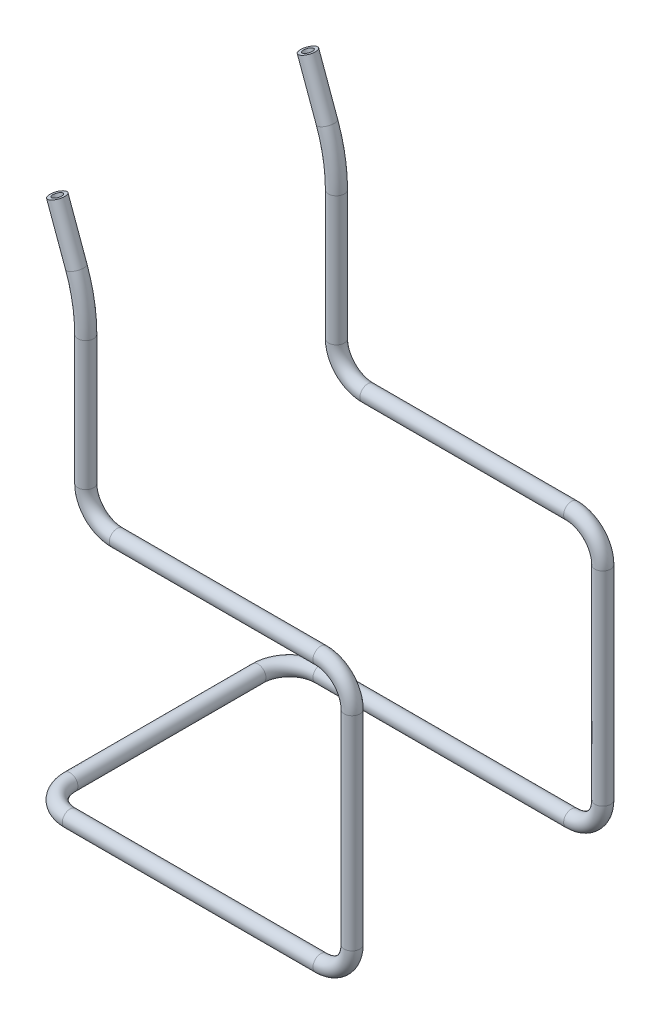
ISO-10303-21;
HEADER;
FILE_DESCRIPTION(('STEP AP214'),'2;1');
FILE_NAME('part.step','',(''),(''),'','','');
FILE_SCHEMA(('AUTOMOTIVE_DESIGN { 1 0 10303 214 1 1 1 1 }'));
ENDSEC;
DATA;
#1=APPLICATION_CONTEXT('core data for automotive mechanical design processes');
#2=APPLICATION_PROTOCOL_DEFINITION('international standard','automotive_design',2000,#1);
#3=PRODUCT_CONTEXT('',#1,'mechanical');
#4=PRODUCT('Part','Part','',(#3));
#5=PRODUCT_RELATED_PRODUCT_CATEGORY('part','',(#4));
#6=PRODUCT_DEFINITION_FORMATION('','',#4);
#7=PRODUCT_DEFINITION_CONTEXT('part definition',#1,'design');
#8=PRODUCT_DEFINITION('design','',#6,#7);
#9=PRODUCT_DEFINITION_SHAPE('','',#8);
#10=(LENGTH_UNIT() NAMED_UNIT(*) SI_UNIT(.MILLI.,.METRE.));
#11=(NAMED_UNIT(*) PLANE_ANGLE_UNIT() SI_UNIT($,.RADIAN.));
#12=(NAMED_UNIT(*) SI_UNIT($,.STERADIAN.) SOLID_ANGLE_UNIT());
#13=UNCERTAINTY_MEASURE_WITH_UNIT(LENGTH_MEASURE(1.E-05),#10,'distance_accuracy_value','');
#14=(GEOMETRIC_REPRESENTATION_CONTEXT(3) GLOBAL_UNCERTAINTY_ASSIGNED_CONTEXT((#13)) GLOBAL_UNIT_ASSIGNED_CONTEXT((#10,
#11,#12)) REPRESENTATION_CONTEXT('',''));
#15=CARTESIAN_POINT('',(0.,0.,0.));
#16=DIRECTION('',(0.,0.,1.));
#17=DIRECTION('',(1.,0.,0.));
#18=AXIS2_PLACEMENT_3D('',#15,#16,#17);
#19=CARTESIAN_POINT('',(11.9846310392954,153.28465813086,40.));
#20=DIRECTION('',(-0.34202014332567,0.939692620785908,0.));
#21=DIRECTION('',(-0.939692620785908,-0.34202014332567,0.));
#22=AXIS2_PLACEMENT_3D('',#19,#20,#21);
#23=CYLINDRICAL_SURFACE('',#22,2.5);
#24=CARTESIAN_POINT('',(11.9846310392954,153.28465813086,40.));
#25=DIRECTION('',(-0.34202014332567,0.939692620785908,0.));
#26=DIRECTION('',(0.,0.,-1.));
#27=AXIS2_PLACEMENT_3D('',#24,#25,#26);
#28=CIRCLE('',#27,2.5);
#29=CARTESIAN_POINT('',(14.3338625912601,154.139708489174,40.));
#30=VERTEX_POINT('',#29);
#31=EDGE_CURVE('E35',#30,#30,#28,.T.);
#32=ORIENTED_EDGE('',*,*,#31,.T.);
#33=EDGE_LOOP('',(#32));
#34=FACE_BOUND('',#33,.T.);
#35=CARTESIAN_POINT('',(5.90074414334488,170.,40.));
#36=DIRECTION('',(-0.34202014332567,0.939692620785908,0.));
#37=DIRECTION('',(0.,0.,-1.));
#38=AXIS2_PLACEMENT_3D('',#35,#36,#37);
#39=CIRCLE('',#38,2.5);
#40=CARTESIAN_POINT('',(5.90074414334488,170.,37.5));
#41=VERTEX_POINT('',#40);
#42=EDGE_CURVE('E10',#41,#41,#39,.T.);
#43=ORIENTED_EDGE('',*,*,#42,.F.);
#44=EDGE_LOOP('',(#43));
#45=FACE_BOUND('',#44,.T.);
#46=ADVANCED_FACE('F29',(#34,#45),#23,.T.);
#47=CARTESIAN_POINT('',(-35.,136.183650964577,40.));
#48=DIRECTION('',(0.,0.,1.));
#49=DIRECTION('',(1.,0.,0.));
#50=AXIS2_PLACEMENT_3D('',#47,#48,#49);
#51=TOROIDAL_SURFACE('',#50,50.,2.5);
#52=CARTESIAN_POINT('',(15.,136.183650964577,40.));
#53=DIRECTION('',(0.,1.,0.));
#54=DIRECTION('',(0.,0.,-1.));
#55=AXIS2_PLACEMENT_3D('',#52,#53,#54);
#56=CIRCLE('',#55,2.5);
#57=CARTESIAN_POINT('',(17.5,136.183650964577,40.));
#58=VERTEX_POINT('',#57);
#59=EDGE_CURVE('E39',#58,#58,#56,.T.);
#60=CARTESIAN_POINT('',(-35.,136.183650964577,40.));
#61=DIRECTION('',(0.,0.,1.));
#62=DIRECTION('',(1.,0.,0.));
#63=AXIS2_PLACEMENT_3D('',#60,#61,#62);
#64=CIRCLE('',#63,52.5);
#65=EDGE_CURVE('',#58,#30,#64,.T.);
#66=ORIENTED_EDGE('',*,*,#59,.T.);
#67=ORIENTED_EDGE('',*,*,#31,.F.);
#68=ORIENTED_EDGE('',*,*,#65,.T.);
#69=ORIENTED_EDGE('',*,*,#65,.F.);
#70=EDGE_LOOP('',(#66,#68,#67,#69));
#71=FACE_BOUND('',#70,.T.);
#72=ADVANCED_FACE('F187',(#71),#51,.T.);
#73=CARTESIAN_POINT('',(15.,95.,40.));
#74=DIRECTION('',(0.,1.,0.));
#75=DIRECTION('',(0.,0.,1.));
#76=AXIS2_PLACEMENT_3D('',#73,#74,#75);
#77=CYLINDRICAL_SURFACE('',#76,2.5);
#78=CARTESIAN_POINT('',(15.,95.,40.));
#79=DIRECTION('',(0.,1.,0.));
#80=DIRECTION('',(0.,0.,-1.));
#81=AXIS2_PLACEMENT_3D('',#78,#79,#80);
#82=CIRCLE('',#81,2.5);
#83=CARTESIAN_POINT('',(12.5,95.,40.));
#84=VERTEX_POINT('',#83);
#85=EDGE_CURVE('E43',#84,#84,#82,.T.);
#86=ORIENTED_EDGE('',*,*,#85,.T.);
#87=EDGE_LOOP('',(#86));
#88=FACE_BOUND('',#87,.T.);
#89=ORIENTED_EDGE('',*,*,#59,.F.);
#90=EDGE_LOOP('',(#89));
#91=FACE_BOUND('',#90,.T.);
#92=ADVANCED_FACE('F191',(#88,#91),#77,.T.);
#93=CARTESIAN_POINT('',(25.,95.,40.));
#94=DIRECTION('',(0.,0.,-1.));
#95=DIRECTION('',(-1.,0.,0.));
#96=AXIS2_PLACEMENT_3D('',#93,#94,#95);
#97=TOROIDAL_SURFACE('',#96,10.,2.5);
#98=CARTESIAN_POINT('',(25.,85.,40.));
#99=DIRECTION('',(-1.,0.,0.));
#100=DIRECTION('',(0.,0.,-1.));
#101=AXIS2_PLACEMENT_3D('',#98,#99,#100);
#102=CIRCLE('',#101,2.5);
#103=CARTESIAN_POINT('',(25.,82.5,40.));
#104=VERTEX_POINT('',#103);
#105=EDGE_CURVE('E48',#104,#104,#102,.T.);
#106=CARTESIAN_POINT('',(25.,95.,40.));
#107=DIRECTION('',(0.,0.,-1.));
#108=DIRECTION('',(-1.,0.,0.));
#109=AXIS2_PLACEMENT_3D('',#106,#107,#108);
#110=CIRCLE('',#109,12.5);
#111=EDGE_CURVE('',#104,#84,#110,.T.);
#112=ORIENTED_EDGE('',*,*,#105,.T.);
#113=ORIENTED_EDGE('',*,*,#85,.F.);
#114=ORIENTED_EDGE('',*,*,#111,.T.);
#115=ORIENTED_EDGE('',*,*,#111,.F.);
#116=EDGE_LOOP('',(#112,#114,#113,#115));
#117=FACE_BOUND('',#116,.T.);
#118=ADVANCED_FACE('F197',(#117),#97,.T.);
#119=CARTESIAN_POINT('',(90.,85.,40.));
#120=DIRECTION('',(-1.,0.,0.));
#121=DIRECTION('',(0.,0.,1.));
#122=AXIS2_PLACEMENT_3D('',#119,#120,#121);
#123=CYLINDRICAL_SURFACE('',#122,2.5);
#124=CARTESIAN_POINT('',(90.,85.,40.));
#125=DIRECTION('',(-1.,0.,0.));
#126=DIRECTION('',(0.,0.,-1.));
#127=AXIS2_PLACEMENT_3D('',#124,#125,#126);
#128=CIRCLE('',#127,2.5);
#129=CARTESIAN_POINT('',(90.,87.5,40.));
#130=VERTEX_POINT('',#129);
#131=EDGE_CURVE('E51',#130,#130,#128,.T.);
#132=ORIENTED_EDGE('',*,*,#131,.T.);
#133=EDGE_LOOP('',(#132));
#134=FACE_BOUND('',#133,.T.);
#135=ORIENTED_EDGE('',*,*,#105,.F.);
#136=EDGE_LOOP('',(#135));
#137=FACE_BOUND('',#136,.T.);
#138=ADVANCED_FACE('F204',(#134,#137),#123,.T.);
#139=CARTESIAN_POINT('',(90.,75.,40.));
#140=DIRECTION('',(0.,0.,1.));
#141=DIRECTION('',(1.,0.,0.));
#142=AXIS2_PLACEMENT_3D('',#139,#140,#141);
#143=TOROIDAL_SURFACE('',#142,9.99999999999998,2.5);
#144=CARTESIAN_POINT('',(100.,75.,40.));
#145=DIRECTION('',(0.,1.,0.));
#146=DIRECTION('',(0.,0.,-1.));
#147=AXIS2_PLACEMENT_3D('',#144,#145,#146);
#148=CIRCLE('',#147,2.5);
#149=CARTESIAN_POINT('',(102.5,75.,40.));
#150=VERTEX_POINT('',#149);
#151=EDGE_CURVE('E54',#150,#150,#148,.T.);
#152=CARTESIAN_POINT('',(90.,75.,40.));
#153=DIRECTION('',(0.,0.,1.));
#154=DIRECTION('',(1.,0.,0.));
#155=AXIS2_PLACEMENT_3D('',#152,#153,#154);
#156=CIRCLE('',#155,12.5);
#157=EDGE_CURVE('',#150,#130,#156,.T.);
#158=ORIENTED_EDGE('',*,*,#151,.T.);
#159=ORIENTED_EDGE('',*,*,#131,.F.);
#160=ORIENTED_EDGE('',*,*,#157,.T.);
#161=ORIENTED_EDGE('',*,*,#157,.F.);
#162=EDGE_LOOP('',(#158,#160,#159,#161));
#163=FACE_BOUND('',#162,.T.);
#164=ADVANCED_FACE('F208',(#163),#143,.T.);
#165=CARTESIAN_POINT('',(100.,9.99999999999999,40.));
#166=DIRECTION('',(0.,1.,0.));
#167=DIRECTION('',(0.,0.,1.));
#168=AXIS2_PLACEMENT_3D('',#165,#166,#167);
#169=CYLINDRICAL_SURFACE('',#168,2.5);
#170=CARTESIAN_POINT('',(100.,9.99999999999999,40.));
#171=DIRECTION('',(0.,1.,0.));
#172=DIRECTION('',(0.,0.,-1.));
#173=AXIS2_PLACEMENT_3D('',#170,#171,#172);
#174=CIRCLE('',#173,2.5);
#175=CARTESIAN_POINT('',(102.5,9.99999999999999,40.));
#176=VERTEX_POINT('',#175);
#177=EDGE_CURVE('E57',#176,#176,#174,.T.);
#178=ORIENTED_EDGE('',*,*,#177,.T.);
#179=EDGE_LOOP('',(#178));
#180=FACE_BOUND('',#179,.T.);
#181=ORIENTED_EDGE('',*,*,#151,.F.);
#182=EDGE_LOOP('',(#181));
#183=FACE_BOUND('',#182,.T.);
#184=ADVANCED_FACE('F212',(#180,#183),#169,.T.);
#185=CARTESIAN_POINT('',(90.,10.,40.));
#186=DIRECTION('',(0.,0.,1.));
#187=DIRECTION('',(1.,0.,0.));
#188=AXIS2_PLACEMENT_3D('',#185,#186,#187);
#189=TOROIDAL_SURFACE('',#188,10.,2.5);
#190=CARTESIAN_POINT('',(90.,0.,40.));
#191=DIRECTION('',(1.,0.,0.));
#192=DIRECTION('',(0.,0.,-1.));
#193=AXIS2_PLACEMENT_3D('',#190,#191,#192);
#194=CIRCLE('',#193,2.5);
#195=CARTESIAN_POINT('',(90.,-2.5,40.));
#196=VERTEX_POINT('',#195);
#197=EDGE_CURVE('E60',#196,#196,#194,.T.);
#198=CARTESIAN_POINT('',(90.,10.,40.));
#199=DIRECTION('',(0.,0.,1.));
#200=DIRECTION('',(1.,0.,0.));
#201=AXIS2_PLACEMENT_3D('',#198,#199,#200);
#202=CIRCLE('',#201,12.5);
#203=EDGE_CURVE('',#196,#176,#202,.T.);
#204=ORIENTED_EDGE('',*,*,#197,.T.);
#205=ORIENTED_EDGE('',*,*,#177,.F.);
#206=ORIENTED_EDGE('',*,*,#203,.T.);
#207=ORIENTED_EDGE('',*,*,#203,.F.);
#208=EDGE_LOOP('',(#204,#206,#205,#207));
#209=FACE_BOUND('',#208,.T.);
#210=ADVANCED_FACE('F216',(#209),#189,.T.);
#211=CARTESIAN_POINT('',(10.,0.,40.));
#212=DIRECTION('',(1.,0.,0.));
#213=DIRECTION('',(0.,0.,-1.));
#214=AXIS2_PLACEMENT_3D('',#211,#212,#213);
#215=CYLINDRICAL_SURFACE('',#214,2.5);
#216=CARTESIAN_POINT('',(10.,0.,40.));
#217=DIRECTION('',(1.,0.,0.));
#218=DIRECTION('',(0.,0.,-1.));
#219=AXIS2_PLACEMENT_3D('',#216,#217,#218);
#220=CIRCLE('',#219,2.5);
#221=CARTESIAN_POINT('',(10.,0.,42.5));
#222=VERTEX_POINT('',#221);
#223=EDGE_CURVE('E63',#222,#222,#220,.T.);
#224=ORIENTED_EDGE('',*,*,#223,.T.);
#225=EDGE_LOOP('',(#224));
#226=FACE_BOUND('',#225,.T.);
#227=ORIENTED_EDGE('',*,*,#197,.F.);
#228=EDGE_LOOP('',(#227));
#229=FACE_BOUND('',#228,.T.);
#230=ADVANCED_FACE('F220',(#226,#229),#215,.T.);
#231=CARTESIAN_POINT('',(10.,0.,30.));
#232=DIRECTION('',(0.,1.,0.));
#233=DIRECTION('',(0.,0.,1.));
#234=AXIS2_PLACEMENT_3D('',#231,#232,#233);
#235=TOROIDAL_SURFACE('',#234,10.,2.5);
#236=CARTESIAN_POINT('',(0.,0.,30.));
#237=DIRECTION('',(0.,0.,1.));
#238=DIRECTION('',(1.,0.,0.));
#239=AXIS2_PLACEMENT_3D('',#236,#237,#238);
#240=CIRCLE('',#239,2.5);
#241=CARTESIAN_POINT('',(-2.5,0.,30.));
#242=VERTEX_POINT('',#241);
#243=EDGE_CURVE('E66',#242,#242,#240,.T.);
#244=CARTESIAN_POINT('',(10.,0.,30.));
#245=DIRECTION('',(0.,1.,0.));
#246=DIRECTION('',(0.,0.,1.));
#247=AXIS2_PLACEMENT_3D('',#244,#245,#246);
#248=CIRCLE('',#247,12.5);
#249=EDGE_CURVE('',#242,#222,#248,.T.);
#250=ORIENTED_EDGE('',*,*,#243,.T.);
#251=ORIENTED_EDGE('',*,*,#223,.F.);
#252=ORIENTED_EDGE('',*,*,#249,.T.);
#253=ORIENTED_EDGE('',*,*,#249,.F.);
#254=EDGE_LOOP('',(#250,#252,#251,#253));
#255=FACE_BOUND('',#254,.T.);
#256=ADVANCED_FACE('F224',(#255),#235,.T.);
#257=CARTESIAN_POINT('',(0.,0.,30.));
#258=DIRECTION('',(0.,0.,-1.));
#259=DIRECTION('',(-1.,0.,0.));
#260=AXIS2_PLACEMENT_3D('',#257,#258,#259);
#261=CYLINDRICAL_SURFACE('',#260,2.5);
#262=ORIENTED_EDGE('',*,*,#243,.F.);
#263=EDGE_LOOP('',(#262));
#264=FACE_BOUND('',#263,.T.);
#265=CARTESIAN_POINT('',(0.,0.,-30.));
#266=DIRECTION('',(0.,0.,1.));
#267=DIRECTION('',(1.,0.,0.));
#268=AXIS2_PLACEMENT_3D('',#265,#266,#267);
#269=CIRCLE('',#268,2.5);
#270=CARTESIAN_POINT('',(-2.5,0.,-30.));
#271=VERTEX_POINT('',#270);
#272=EDGE_CURVE('E132',#271,#271,#269,.T.);
#273=ORIENTED_EDGE('',*,*,#272,.T.);
#274=EDGE_LOOP('',(#273));
#275=FACE_BOUND('',#274,.T.);
#276=ADVANCED_FACE('F228',(#264,#275),#261,.T.);
#277=CARTESIAN_POINT('',(5.90074414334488,170.,40.));
#278=DIRECTION('',(-0.34202014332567,0.939692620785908,0.));
#279=DIRECTION('',(0.,0.,-1.));
#280=AXIS2_PLACEMENT_3D('',#277,#278,#279);
#281=PLANE('',#280);
#282=CARTESIAN_POINT('',(5.90074414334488,170.,40.));
#283=DIRECTION('',(-0.34202014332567,0.939692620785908,0.));
#284=DIRECTION('',(-0.939692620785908,-0.34202014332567,0.));
#285=AXIS2_PLACEMENT_3D('',#282,#283,#284);
#286=CIRCLE('',#285,1.5);
#287=CARTESIAN_POINT('',(4.49120521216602,169.486969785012,40.));
#288=VERTEX_POINT('',#287);
#289=EDGE_CURVE('E69',#288,#288,#286,.T.);
#290=ORIENTED_EDGE('',*,*,#289,.F.);
#291=EDGE_LOOP('',(#290));
#292=FACE_BOUND('',#291,.T.);
#293=ORIENTED_EDGE('',*,*,#42,.T.);
#294=EDGE_LOOP('',(#293));
#295=FACE_BOUND('',#294,.T.);
#296=ADVANCED_FACE('F232',(#292,#295),#281,.T.);
#297=CARTESIAN_POINT('',(11.9846310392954,153.28465813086,40.));
#298=DIRECTION('',(-0.34202014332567,0.939692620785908,0.));
#299=DIRECTION('',(-0.939692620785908,-0.34202014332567,0.));
#300=AXIS2_PLACEMENT_3D('',#297,#298,#299);
#301=CYLINDRICAL_SURFACE('',#300,1.5);
#302=CARTESIAN_POINT('',(11.9846310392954,153.28465813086,40.));
#303=DIRECTION('',(-0.34202014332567,0.939692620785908,0.));
#304=DIRECTION('',(-0.939692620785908,-0.34202014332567,0.));
#305=AXIS2_PLACEMENT_3D('',#302,#303,#304);
#306=CIRCLE('',#305,1.5);
#307=CARTESIAN_POINT('',(13.3941699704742,153.797688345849,40.));
#308=VERTEX_POINT('',#307);
#309=EDGE_CURVE('E72',#308,#308,#306,.T.);
#310=ORIENTED_EDGE('',*,*,#309,.F.);
#311=EDGE_LOOP('',(#310));
#312=FACE_BOUND('',#311,.T.);
#313=ORIENTED_EDGE('',*,*,#289,.T.);
#314=EDGE_LOOP('',(#313));
#315=FACE_BOUND('',#314,.T.);
#316=ADVANCED_FACE('F236',(#312,#315),#301,.F.);
#317=CARTESIAN_POINT('',(-35.,136.183650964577,40.));
#318=DIRECTION('',(0.,0.,1.));
#319=DIRECTION('',(1.,0.,0.));
#320=AXIS2_PLACEMENT_3D('',#317,#318,#319);
#321=TOROIDAL_SURFACE('',#320,50.,1.5);
#322=CARTESIAN_POINT('',(15.,136.183650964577,40.));
#323=DIRECTION('',(0.,-1.,0.));
#324=DIRECTION('',(0.,0.,-1.));
#325=AXIS2_PLACEMENT_3D('',#322,#323,#324);
#326=CIRCLE('',#325,1.5);
#327=CARTESIAN_POINT('',(16.5,136.183650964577,40.));
#328=VERTEX_POINT('',#327);
#329=EDGE_CURVE('E98',#328,#328,#326,.F.);
#330=CARTESIAN_POINT('',(-35.,136.183650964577,40.));
#331=DIRECTION('',(0.,0.,1.));
#332=DIRECTION('',(1.,0.,0.));
#333=AXIS2_PLACEMENT_3D('',#330,#331,#332);
#334=CIRCLE('',#333,51.5);
#335=EDGE_CURVE('',#328,#308,#334,.T.);
#336=ORIENTED_EDGE('',*,*,#329,.F.);
#337=ORIENTED_EDGE('',*,*,#309,.T.);
#338=ORIENTED_EDGE('',*,*,#335,.T.);
#339=ORIENTED_EDGE('',*,*,#335,.F.);
#340=EDGE_LOOP('',(#336,#338,#337,#339));
#341=FACE_BOUND('',#340,.T.);
#342=ADVANCED_FACE('F274',(#341),#321,.F.);
#343=CARTESIAN_POINT('',(15.,95.,40.));
#344=DIRECTION('',(0.,1.,0.));
#345=DIRECTION('',(0.,0.,1.));
#346=AXIS2_PLACEMENT_3D('',#343,#344,#345);
#347=CYLINDRICAL_SURFACE('',#346,1.5);
#348=CARTESIAN_POINT('',(15.,95.,40.));
#349=DIRECTION('',(0.,1.,0.));
#350=DIRECTION('',(0.,0.,1.));
#351=AXIS2_PLACEMENT_3D('',#348,#349,#350);
#352=CIRCLE('',#351,1.5);
#353=CARTESIAN_POINT('',(13.5,95.,40.));
#354=VERTEX_POINT('',#353);
#355=EDGE_CURVE('E95',#354,#354,#352,.T.);
#356=ORIENTED_EDGE('',*,*,#355,.F.);
#357=EDGE_LOOP('',(#356));
#358=FACE_BOUND('',#357,.T.);
#359=ORIENTED_EDGE('',*,*,#329,.T.);
#360=EDGE_LOOP('',(#359));
#361=FACE_BOUND('',#360,.T.);
#362=ADVANCED_FACE('F270',(#358,#361),#347,.F.);
#363=CARTESIAN_POINT('',(25.,95.,40.));
#364=DIRECTION('',(0.,0.,-1.));
#365=DIRECTION('',(-1.,0.,0.));
#366=AXIS2_PLACEMENT_3D('',#363,#364,#365);
#367=TOROIDAL_SURFACE('',#366,10.,1.5);
#368=CARTESIAN_POINT('',(25.,85.,40.));
#369=DIRECTION('',(1.,0.,0.));
#370=DIRECTION('',(0.,1.,0.));
#371=AXIS2_PLACEMENT_3D('',#368,#369,#370);
#372=CIRCLE('',#371,1.5);
#373=CARTESIAN_POINT('',(25.,83.5,40.));
#374=VERTEX_POINT('',#373);
#375=EDGE_CURVE('E92',#374,#374,#372,.F.);
#376=CARTESIAN_POINT('',(25.,95.,40.));
#377=DIRECTION('',(0.,0.,-1.));
#378=DIRECTION('',(-1.,0.,0.));
#379=AXIS2_PLACEMENT_3D('',#376,#377,#378);
#380=CIRCLE('',#379,11.5);
#381=EDGE_CURVE('',#374,#354,#380,.T.);
#382=ORIENTED_EDGE('',*,*,#375,.F.);
#383=ORIENTED_EDGE('',*,*,#355,.T.);
#384=ORIENTED_EDGE('',*,*,#381,.T.);
#385=ORIENTED_EDGE('',*,*,#381,.F.);
#386=EDGE_LOOP('',(#382,#384,#383,#385));
#387=FACE_BOUND('',#386,.T.);
#388=ADVANCED_FACE('F266',(#387),#367,.F.);
#389=CARTESIAN_POINT('',(90.,85.,40.));
#390=DIRECTION('',(-1.,0.,0.));
#391=DIRECTION('',(0.,0.,1.));
#392=AXIS2_PLACEMENT_3D('',#389,#390,#391);
#393=CYLINDRICAL_SURFACE('',#392,1.5);
#394=CARTESIAN_POINT('',(90.,85.,40.));
#395=DIRECTION('',(-1.,0.,0.));
#396=DIRECTION('',(0.,0.,1.));
#397=AXIS2_PLACEMENT_3D('',#394,#395,#396);
#398=CIRCLE('',#397,1.5);
#399=CARTESIAN_POINT('',(90.,86.5,40.));
#400=VERTEX_POINT('',#399);
#401=EDGE_CURVE('E89',#400,#400,#398,.T.);
#402=ORIENTED_EDGE('',*,*,#401,.F.);
#403=EDGE_LOOP('',(#402));
#404=FACE_BOUND('',#403,.T.);
#405=ORIENTED_EDGE('',*,*,#375,.T.);
#406=EDGE_LOOP('',(#405));
#407=FACE_BOUND('',#406,.T.);
#408=ADVANCED_FACE('F262',(#404,#407),#393,.F.);
#409=CARTESIAN_POINT('',(90.,75.,40.));
#410=DIRECTION('',(0.,0.,1.));
#411=DIRECTION('',(1.,0.,0.));
#412=AXIS2_PLACEMENT_3D('',#409,#410,#411);
#413=TOROIDAL_SURFACE('',#412,9.99999999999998,1.5);
#414=CARTESIAN_POINT('',(100.,75.,40.));
#415=DIRECTION('',(0.,-1.,0.));
#416=DIRECTION('',(0.,0.,-1.));
#417=AXIS2_PLACEMENT_3D('',#414,#415,#416);
#418=CIRCLE('',#417,1.5);
#419=CARTESIAN_POINT('',(101.5,75.,40.));
#420=VERTEX_POINT('',#419);
#421=EDGE_CURVE('E86',#420,#420,#418,.F.);
#422=CARTESIAN_POINT('',(90.,75.,40.));
#423=DIRECTION('',(0.,0.,1.));
#424=DIRECTION('',(1.,0.,0.));
#425=AXIS2_PLACEMENT_3D('',#422,#423,#424);
#426=CIRCLE('',#425,11.5);
#427=EDGE_CURVE('',#420,#400,#426,.T.);
#428=ORIENTED_EDGE('',*,*,#421,.F.);
#429=ORIENTED_EDGE('',*,*,#401,.T.);
#430=ORIENTED_EDGE('',*,*,#427,.T.);
#431=ORIENTED_EDGE('',*,*,#427,.F.);
#432=EDGE_LOOP('',(#428,#430,#429,#431));
#433=FACE_BOUND('',#432,.T.);
#434=ADVANCED_FACE('F258',(#433),#413,.F.);
#435=CARTESIAN_POINT('',(100.,9.99999999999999,40.));
#436=DIRECTION('',(0.,1.,0.));
#437=DIRECTION('',(0.,0.,1.));
#438=AXIS2_PLACEMENT_3D('',#435,#436,#437);
#439=CYLINDRICAL_SURFACE('',#438,1.5);
#440=CARTESIAN_POINT('',(100.,9.99999999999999,40.));
#441=DIRECTION('',(0.,1.,0.));
#442=DIRECTION('',(0.,0.,1.));
#443=AXIS2_PLACEMENT_3D('',#440,#441,#442);
#444=CIRCLE('',#443,1.5);
#445=CARTESIAN_POINT('',(101.5,9.99999999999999,40.));
#446=VERTEX_POINT('',#445);
#447=EDGE_CURVE('E83',#446,#446,#444,.T.);
#448=ORIENTED_EDGE('',*,*,#447,.F.);
#449=EDGE_LOOP('',(#448));
#450=FACE_BOUND('',#449,.T.);
#451=ORIENTED_EDGE('',*,*,#421,.T.);
#452=EDGE_LOOP('',(#451));
#453=FACE_BOUND('',#452,.T.);
#454=ADVANCED_FACE('F254',(#450,#453),#439,.F.);
#455=CARTESIAN_POINT('',(90.,10.,40.));
#456=DIRECTION('',(0.,0.,1.));
#457=DIRECTION('',(1.,0.,0.));
#458=AXIS2_PLACEMENT_3D('',#455,#456,#457);
#459=TOROIDAL_SURFACE('',#458,10.,1.5);
#460=CARTESIAN_POINT('',(90.,0.,40.));
#461=DIRECTION('',(-1.,0.,0.));
#462=DIRECTION('',(0.,-1.,0.));
#463=AXIS2_PLACEMENT_3D('',#460,#461,#462);
#464=CIRCLE('',#463,1.5);
#465=CARTESIAN_POINT('',(90.,-1.5,40.));
#466=VERTEX_POINT('',#465);
#467=EDGE_CURVE('E80',#466,#466,#464,.F.);
#468=CARTESIAN_POINT('',(90.,10.,40.));
#469=DIRECTION('',(0.,0.,1.));
#470=DIRECTION('',(1.,0.,0.));
#471=AXIS2_PLACEMENT_3D('',#468,#469,#470);
#472=CIRCLE('',#471,11.5);
#473=EDGE_CURVE('',#466,#446,#472,.T.);
#474=ORIENTED_EDGE('',*,*,#467,.F.);
#475=ORIENTED_EDGE('',*,*,#447,.T.);
#476=ORIENTED_EDGE('',*,*,#473,.T.);
#477=ORIENTED_EDGE('',*,*,#473,.F.);
#478=EDGE_LOOP('',(#474,#476,#475,#477));
#479=FACE_BOUND('',#478,.T.);
#480=ADVANCED_FACE('F250',(#479),#459,.F.);
#481=CARTESIAN_POINT('',(10.,0.,40.));
#482=DIRECTION('',(1.,0.,0.));
#483=DIRECTION('',(0.,0.,-1.));
#484=AXIS2_PLACEMENT_3D('',#481,#482,#483);
#485=CYLINDRICAL_SURFACE('',#484,1.5);
#486=CARTESIAN_POINT('',(10.,0.,40.));
#487=DIRECTION('',(1.,0.,0.));
#488=DIRECTION('',(0.,0.,-1.));
#489=AXIS2_PLACEMENT_3D('',#486,#487,#488);
#490=CIRCLE('',#489,1.5);
#491=CARTESIAN_POINT('',(10.,0.,41.5));
#492=VERTEX_POINT('',#491);
#493=EDGE_CURVE('E76',#492,#492,#490,.T.);
#494=ORIENTED_EDGE('',*,*,#493,.F.);
#495=EDGE_LOOP('',(#494));
#496=FACE_BOUND('',#495,.T.);
#497=ORIENTED_EDGE('',*,*,#467,.T.);
#498=EDGE_LOOP('',(#497));
#499=FACE_BOUND('',#498,.T.);
#500=ADVANCED_FACE('F246',(#496,#499),#485,.F.);
#501=CARTESIAN_POINT('',(10.,0.,30.));
#502=DIRECTION('',(0.,1.,0.));
#503=DIRECTION('',(0.,0.,1.));
#504=AXIS2_PLACEMENT_3D('',#501,#502,#503);
#505=TOROIDAL_SURFACE('',#504,10.,1.5);
#506=CARTESIAN_POINT('',(0.,0.,30.));
#507=DIRECTION('',(0.,0.,-1.));
#508=DIRECTION('',(-1.,0.,0.));
#509=AXIS2_PLACEMENT_3D('',#506,#507,#508);
#510=CIRCLE('',#509,1.5);
#511=CARTESIAN_POINT('',(-1.5,0.,30.));
#512=VERTEX_POINT('',#511);
#513=EDGE_CURVE('E73',#512,#512,#510,.F.);
#514=CARTESIAN_POINT('',(10.,0.,30.));
#515=DIRECTION('',(0.,1.,0.));
#516=DIRECTION('',(0.,0.,1.));
#517=AXIS2_PLACEMENT_3D('',#514,#515,#516);
#518=CIRCLE('',#517,11.5);
#519=EDGE_CURVE('',#512,#492,#518,.T.);
#520=ORIENTED_EDGE('',*,*,#513,.F.);
#521=ORIENTED_EDGE('',*,*,#493,.T.);
#522=ORIENTED_EDGE('',*,*,#519,.T.);
#523=ORIENTED_EDGE('',*,*,#519,.F.);
#524=EDGE_LOOP('',(#520,#522,#521,#523));
#525=FACE_BOUND('',#524,.T.);
#526=ADVANCED_FACE('F242',(#525),#505,.F.);
#527=CARTESIAN_POINT('',(0.,0.,30.));
#528=DIRECTION('',(0.,0.,-1.));
#529=DIRECTION('',(-1.,0.,0.));
#530=AXIS2_PLACEMENT_3D('',#527,#528,#529);
#531=CYLINDRICAL_SURFACE('',#530,1.5);
#532=ORIENTED_EDGE('',*,*,#513,.T.);
#533=EDGE_LOOP('',(#532));
#534=FACE_BOUND('',#533,.T.);
#535=CARTESIAN_POINT('',(0.,0.,-30.));
#536=DIRECTION('',(0.,0.,1.));
#537=DIRECTION('',(1.,0.,0.));
#538=AXIS2_PLACEMENT_3D('',#535,#536,#537);
#539=CIRCLE('',#538,1.5);
#540=CARTESIAN_POINT('',(-1.5,0.,-30.));
#541=VERTEX_POINT('',#540);
#542=EDGE_CURVE('E139',#541,#541,#539,.T.);
#543=ORIENTED_EDGE('',*,*,#542,.F.);
#544=EDGE_LOOP('',(#543));
#545=FACE_BOUND('',#544,.T.);
#546=ADVANCED_FACE('F238',(#534,#545),#531,.F.);
#547=CARTESIAN_POINT('',(5.90074414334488,170.,-40.));
#548=DIRECTION('',(-0.34202014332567,0.939692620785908,0.));
#549=DIRECTION('',(0.,0.,1.));
#550=AXIS2_PLACEMENT_3D('',#547,#548,#549);
#551=PLANE('',#550);
#552=CARTESIAN_POINT('',(5.90074414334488,170.,-40.));
#553=DIRECTION('',(0.34202014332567,-0.939692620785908,0.));
#554=DIRECTION('',(0.,0.,1.));
#555=AXIS2_PLACEMENT_3D('',#552,#553,#554);
#556=CIRCLE('',#555,2.5);
#557=CARTESIAN_POINT('',(5.90074414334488,170.,-37.5));
#558=VERTEX_POINT('',#557);
#559=EDGE_CURVE('E77',#558,#558,#556,.T.);
#560=ORIENTED_EDGE('',*,*,#559,.F.);
#561=EDGE_LOOP('',(#560));
#562=FACE_BOUND('',#561,.T.);
#563=CARTESIAN_POINT('',(5.90074414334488,170.,-40.));
#564=DIRECTION('',(-0.34202014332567,0.939692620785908,0.));
#565=DIRECTION('',(-0.939692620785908,-0.34202014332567,0.));
#566=AXIS2_PLACEMENT_3D('',#563,#564,#565);
#567=CIRCLE('',#566,1.5);
#568=CARTESIAN_POINT('',(4.49120521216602,169.486969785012,-40.));
#569=VERTEX_POINT('',#568);
#570=EDGE_CURVE('E135',#569,#569,#567,.F.);
#571=ORIENTED_EDGE('',*,*,#570,.T.);
#572=EDGE_LOOP('',(#571));
#573=FACE_BOUND('',#572,.T.);
#574=ADVANCED_FACE('F241',(#562,#573),#551,.T.);
#575=CARTESIAN_POINT('',(11.9846310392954,153.28465813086,-40.));
#576=DIRECTION('',(-0.34202014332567,0.939692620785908,0.));
#577=DIRECTION('',(-0.939692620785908,-0.34202014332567,0.));
#578=AXIS2_PLACEMENT_3D('',#575,#576,#577);
#579=CYLINDRICAL_SURFACE('',#578,2.5);
#580=CARTESIAN_POINT('',(11.9846310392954,153.28465813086,-40.));
#581=DIRECTION('',(0.34202014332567,-0.939692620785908,0.));
#582=DIRECTION('',(0.,0.,1.));
#583=AXIS2_PLACEMENT_3D('',#580,#581,#582);
#584=CIRCLE('',#583,2.5);
#585=CARTESIAN_POINT('',(14.3338625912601,154.139708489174,-40.));
#586=VERTEX_POINT('',#585);
#587=EDGE_CURVE('E105',#586,#586,#584,.T.);
#588=ORIENTED_EDGE('',*,*,#587,.F.);
#589=EDGE_LOOP('',(#588));
#590=FACE_BOUND('',#589,.T.);
#591=ORIENTED_EDGE('',*,*,#559,.T.);
#592=EDGE_LOOP('',(#591));
#593=FACE_BOUND('',#592,.T.);
#594=ADVANCED_FACE('F282',(#590,#593),#579,.T.);
#595=CARTESIAN_POINT('',(-35.,136.183650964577,-40.));
#596=DIRECTION('',(0.,0.,1.));
#597=DIRECTION('',(1.,0.,0.));
#598=AXIS2_PLACEMENT_3D('',#595,#596,#597);
#599=TOROIDAL_SURFACE('',#598,50.,2.5);
#600=CARTESIAN_POINT('',(15.,136.183650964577,-40.));
#601=DIRECTION('',(0.,-1.,0.));
#602=DIRECTION('',(0.,0.,1.));
#603=AXIS2_PLACEMENT_3D('',#600,#601,#602);
#604=CIRCLE('',#603,2.5);
#605=CARTESIAN_POINT('',(17.5,136.183650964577,-40.));
#606=VERTEX_POINT('',#605);
#607=EDGE_CURVE('E108',#606,#606,#604,.T.);
#608=CARTESIAN_POINT('',(-35.,136.183650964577,-40.));
#609=DIRECTION('',(0.,0.,1.));
#610=DIRECTION('',(1.,0.,0.));
#611=AXIS2_PLACEMENT_3D('',#608,#609,#610);
#612=CIRCLE('',#611,52.5);
#613=EDGE_CURVE('',#606,#586,#612,.T.);
#614=ORIENTED_EDGE('',*,*,#607,.F.);
#615=ORIENTED_EDGE('',*,*,#587,.T.);
#616=ORIENTED_EDGE('',*,*,#613,.T.);
#617=ORIENTED_EDGE('',*,*,#613,.F.);
#618=EDGE_LOOP('',(#614,#616,#615,#617));
#619=FACE_BOUND('',#618,.T.);
#620=ADVANCED_FACE('F285',(#619),#599,.T.);
#621=CARTESIAN_POINT('',(15.,95.,-40.));
#622=DIRECTION('',(0.,1.,0.));
#623=DIRECTION('',(0.,0.,1.));
#624=AXIS2_PLACEMENT_3D('',#621,#622,#623);
#625=CYLINDRICAL_SURFACE('',#624,2.5);
#626=CARTESIAN_POINT('',(15.,95.,-40.));
#627=DIRECTION('',(0.,-1.,0.));
#628=DIRECTION('',(0.,0.,1.));
#629=AXIS2_PLACEMENT_3D('',#626,#627,#628);
#630=CIRCLE('',#629,2.5);
#631=CARTESIAN_POINT('',(12.5,95.,-40.));
#632=VERTEX_POINT('',#631);
#633=EDGE_CURVE('E111',#632,#632,#630,.T.);
#634=ORIENTED_EDGE('',*,*,#633,.F.);
#635=EDGE_LOOP('',(#634));
#636=FACE_BOUND('',#635,.T.);
#637=ORIENTED_EDGE('',*,*,#607,.T.);
#638=EDGE_LOOP('',(#637));
#639=FACE_BOUND('',#638,.T.);
#640=ADVANCED_FACE('F289',(#636,#639),#625,.T.);
#641=CARTESIAN_POINT('',(25.,95.,-40.));
#642=DIRECTION('',(0.,0.,-1.));
#643=DIRECTION('',(-1.,0.,0.));
#644=AXIS2_PLACEMENT_3D('',#641,#642,#643);
#645=TOROIDAL_SURFACE('',#644,10.,2.5);
#646=CARTESIAN_POINT('',(25.,85.,-40.));
#647=DIRECTION('',(1.,0.,0.));
#648=DIRECTION('',(0.,0.,1.));
#649=AXIS2_PLACEMENT_3D('',#646,#647,#648);
#650=CIRCLE('',#649,2.5);
#651=CARTESIAN_POINT('',(25.,82.5,-40.));
#652=VERTEX_POINT('',#651);
#653=EDGE_CURVE('E114',#652,#652,#650,.T.);
#654=CARTESIAN_POINT('',(25.,95.,-40.));
#655=DIRECTION('',(0.,0.,-1.));
#656=DIRECTION('',(-1.,0.,0.));
#657=AXIS2_PLACEMENT_3D('',#654,#655,#656);
#658=CIRCLE('',#657,12.5);
#659=EDGE_CURVE('',#652,#632,#658,.T.);
#660=ORIENTED_EDGE('',*,*,#653,.F.);
#661=ORIENTED_EDGE('',*,*,#633,.T.);
#662=ORIENTED_EDGE('',*,*,#659,.T.);
#663=ORIENTED_EDGE('',*,*,#659,.F.);
#664=EDGE_LOOP('',(#660,#662,#661,#663));
#665=FACE_BOUND('',#664,.T.);
#666=ADVANCED_FACE('F293',(#665),#645,.T.);
#667=CARTESIAN_POINT('',(90.,85.,-40.));
#668=DIRECTION('',(-1.,0.,0.));
#669=DIRECTION('',(0.,0.,1.));
#670=AXIS2_PLACEMENT_3D('',#667,#668,#669);
#671=CYLINDRICAL_SURFACE('',#670,2.5);
#672=CARTESIAN_POINT('',(90.,85.,-40.));
#673=DIRECTION('',(1.,0.,0.));
#674=DIRECTION('',(0.,0.,1.));
#675=AXIS2_PLACEMENT_3D('',#672,#673,#674);
#676=CIRCLE('',#675,2.5);
#677=CARTESIAN_POINT('',(90.,87.5,-40.));
#678=VERTEX_POINT('',#677);
#679=EDGE_CURVE('E117',#678,#678,#676,.T.);
#680=ORIENTED_EDGE('',*,*,#679,.F.);
#681=EDGE_LOOP('',(#680));
#682=FACE_BOUND('',#681,.T.);
#683=ORIENTED_EDGE('',*,*,#653,.T.);
#684=EDGE_LOOP('',(#683));
#685=FACE_BOUND('',#684,.T.);
#686=ADVANCED_FACE('F297',(#682,#685),#671,.T.);
#687=CARTESIAN_POINT('',(90.,75.,-40.));
#688=DIRECTION('',(0.,0.,1.));
#689=DIRECTION('',(1.,0.,0.));
#690=AXIS2_PLACEMENT_3D('',#687,#688,#689);
#691=TOROIDAL_SURFACE('',#690,9.99999999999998,2.5);
#692=CARTESIAN_POINT('',(100.,75.,-40.));
#693=DIRECTION('',(0.,-1.,0.));
#694=DIRECTION('',(0.,0.,1.));
#695=AXIS2_PLACEMENT_3D('',#692,#693,#694);
#696=CIRCLE('',#695,2.5);
#697=CARTESIAN_POINT('',(102.5,75.,-40.));
#698=VERTEX_POINT('',#697);
#699=EDGE_CURVE('E120',#698,#698,#696,.T.);
#700=CARTESIAN_POINT('',(90.,75.,-40.));
#701=DIRECTION('',(0.,0.,1.));
#702=DIRECTION('',(1.,0.,0.));
#703=AXIS2_PLACEMENT_3D('',#700,#701,#702);
#704=CIRCLE('',#703,12.5);
#705=EDGE_CURVE('',#698,#678,#704,.T.);
#706=ORIENTED_EDGE('',*,*,#699,.F.);
#707=ORIENTED_EDGE('',*,*,#679,.T.);
#708=ORIENTED_EDGE('',*,*,#705,.T.);
#709=ORIENTED_EDGE('',*,*,#705,.F.);
#710=EDGE_LOOP('',(#706,#708,#707,#709));
#711=FACE_BOUND('',#710,.T.);
#712=ADVANCED_FACE('F301',(#711),#691,.T.);
#713=CARTESIAN_POINT('',(100.,9.99999999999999,-40.));
#714=DIRECTION('',(0.,1.,0.));
#715=DIRECTION('',(0.,0.,1.));
#716=AXIS2_PLACEMENT_3D('',#713,#714,#715);
#717=CYLINDRICAL_SURFACE('',#716,2.5);
#718=CARTESIAN_POINT('',(100.,9.99999999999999,-40.));
#719=DIRECTION('',(0.,-1.,0.));
#720=DIRECTION('',(0.,0.,1.));
#721=AXIS2_PLACEMENT_3D('',#718,#719,#720);
#722=CIRCLE('',#721,2.5);
#723=CARTESIAN_POINT('',(102.5,9.99999999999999,-40.));
#724=VERTEX_POINT('',#723);
#725=EDGE_CURVE('E123',#724,#724,#722,.T.);
#726=ORIENTED_EDGE('',*,*,#725,.F.);
#727=EDGE_LOOP('',(#726));
#728=FACE_BOUND('',#727,.T.);
#729=ORIENTED_EDGE('',*,*,#699,.T.);
#730=EDGE_LOOP('',(#729));
#731=FACE_BOUND('',#730,.T.);
#732=ADVANCED_FACE('F305',(#728,#731),#717,.T.);
#733=CARTESIAN_POINT('',(90.,10.,-40.));
#734=DIRECTION('',(0.,0.,1.));
#735=DIRECTION('',(1.,0.,0.));
#736=AXIS2_PLACEMENT_3D('',#733,#734,#735);
#737=TOROIDAL_SURFACE('',#736,10.,2.5);
#738=CARTESIAN_POINT('',(90.,0.,-40.));
#739=DIRECTION('',(-1.,0.,0.));
#740=DIRECTION('',(0.,0.,1.));
#741=AXIS2_PLACEMENT_3D('',#738,#739,#740);
#742=CIRCLE('',#741,2.5);
#743=CARTESIAN_POINT('',(90.,-2.5,-40.));
#744=VERTEX_POINT('',#743);
#745=EDGE_CURVE('E126',#744,#744,#742,.T.);
#746=CARTESIAN_POINT('',(90.,10.,-40.));
#747=DIRECTION('',(0.,0.,1.));
#748=DIRECTION('',(1.,0.,0.));
#749=AXIS2_PLACEMENT_3D('',#746,#747,#748);
#750=CIRCLE('',#749,12.5);
#751=EDGE_CURVE('',#744,#724,#750,.T.);
#752=ORIENTED_EDGE('',*,*,#745,.F.);
#753=ORIENTED_EDGE('',*,*,#725,.T.);
#754=ORIENTED_EDGE('',*,*,#751,.T.);
#755=ORIENTED_EDGE('',*,*,#751,.F.);
#756=EDGE_LOOP('',(#752,#754,#753,#755));
#757=FACE_BOUND('',#756,.T.);
#758=ADVANCED_FACE('F309',(#757),#737,.T.);
#759=CARTESIAN_POINT('',(10.,0.,-40.));
#760=DIRECTION('',(1.,0.,0.));
#761=DIRECTION('',(0.,0.,-1.));
#762=AXIS2_PLACEMENT_3D('',#759,#760,#761);
#763=CYLINDRICAL_SURFACE('',#762,2.5);
#764=CARTESIAN_POINT('',(10.,0.,-40.));
#765=DIRECTION('',(-1.,0.,0.));
#766=DIRECTION('',(0.,0.,1.));
#767=AXIS2_PLACEMENT_3D('',#764,#765,#766);
#768=CIRCLE('',#767,2.5);
#769=CARTESIAN_POINT('',(10.,0.,-42.5));
#770=VERTEX_POINT('',#769);
#771=EDGE_CURVE('E129',#770,#770,#768,.T.);
#772=ORIENTED_EDGE('',*,*,#771,.F.);
#773=EDGE_LOOP('',(#772));
#774=FACE_BOUND('',#773,.T.);
#775=ORIENTED_EDGE('',*,*,#745,.T.);
#776=EDGE_LOOP('',(#775));
#777=FACE_BOUND('',#776,.T.);
#778=ADVANCED_FACE('F313',(#774,#777),#763,.T.);
#779=CARTESIAN_POINT('',(10.,0.,-30.));
#780=DIRECTION('',(0.,-1.,0.));
#781=DIRECTION('',(0.,0.,-1.));
#782=AXIS2_PLACEMENT_3D('',#779,#780,#781);
#783=TOROIDAL_SURFACE('',#782,10.,2.5);
#784=CARTESIAN_POINT('',(10.,0.,-30.));
#785=DIRECTION('',(0.,-1.,0.));
#786=DIRECTION('',(0.,0.,-1.));
#787=AXIS2_PLACEMENT_3D('',#784,#785,#786);
#788=CIRCLE('',#787,12.5);
#789=EDGE_CURVE('',#271,#770,#788,.T.);
#790=ORIENTED_EDGE('',*,*,#272,.F.);
#791=ORIENTED_EDGE('',*,*,#771,.T.);
#792=ORIENTED_EDGE('',*,*,#789,.T.);
#793=ORIENTED_EDGE('',*,*,#789,.F.);
#794=EDGE_LOOP('',(#790,#792,#791,#793));
#795=FACE_BOUND('',#794,.T.);
#796=ADVANCED_FACE('F184',(#795),#783,.T.);
#797=CARTESIAN_POINT('',(11.9846310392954,153.28465813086,-40.));
#798=DIRECTION('',(-0.34202014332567,0.939692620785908,0.));
#799=DIRECTION('',(-0.939692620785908,-0.34202014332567,0.));
#800=AXIS2_PLACEMENT_3D('',#797,#798,#799);
#801=CYLINDRICAL_SURFACE('',#800,1.5);
#802=CARTESIAN_POINT('',(11.9846310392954,153.28465813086,-40.));
#803=DIRECTION('',(0.34202014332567,-0.939692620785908,0.));
#804=DIRECTION('',(0.939692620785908,0.34202014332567,0.));
#805=AXIS2_PLACEMENT_3D('',#802,#803,#804);
#806=CIRCLE('',#805,1.5);
#807=CARTESIAN_POINT('',(13.3941699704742,153.797688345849,-40.));
#808=VERTEX_POINT('',#807);
#809=EDGE_CURVE('E138',#808,#808,#806,.T.);
#810=ORIENTED_EDGE('',*,*,#809,.T.);
#811=EDGE_LOOP('',(#810));
#812=FACE_BOUND('',#811,.T.);
#813=ORIENTED_EDGE('',*,*,#570,.F.);
#814=EDGE_LOOP('',(#813));
#815=FACE_BOUND('',#814,.T.);
#816=ADVANCED_FACE('F169',(#812,#815),#801,.F.);
#817=CARTESIAN_POINT('',(-35.,136.183650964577,-40.));
#818=DIRECTION('',(0.,0.,1.));
#819=DIRECTION('',(1.,0.,0.));
#820=AXIS2_PLACEMENT_3D('',#817,#818,#819);
#821=TOROIDAL_SURFACE('',#820,50.,1.5);
#822=CARTESIAN_POINT('',(15.,136.183650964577,-40.));
#823=DIRECTION('',(0.,1.,0.));
#824=DIRECTION('',(0.,0.,1.));
#825=AXIS2_PLACEMENT_3D('',#822,#823,#824);
#826=CIRCLE('',#825,1.5);
#827=CARTESIAN_POINT('',(16.5,136.183650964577,-40.));
#828=VERTEX_POINT('',#827);
#829=EDGE_CURVE('E163',#828,#828,#826,.F.);
#830=CARTESIAN_POINT('',(-35.,136.183650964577,-40.));
#831=DIRECTION('',(0.,0.,1.));
#832=DIRECTION('',(1.,0.,0.));
#833=AXIS2_PLACEMENT_3D('',#830,#831,#832);
#834=CIRCLE('',#833,51.5);
#835=EDGE_CURVE('',#828,#808,#834,.T.);
#836=ORIENTED_EDGE('',*,*,#829,.T.);
#837=ORIENTED_EDGE('',*,*,#809,.F.);
#838=ORIENTED_EDGE('',*,*,#835,.T.);
#839=ORIENTED_EDGE('',*,*,#835,.F.);
#840=EDGE_LOOP('',(#836,#838,#837,#839));
#841=FACE_BOUND('',#840,.T.);
#842=ADVANCED_FACE('F172',(#841),#821,.F.);
#843=CARTESIAN_POINT('',(15.,95.,-40.));
#844=DIRECTION('',(0.,1.,0.));
#845=DIRECTION('',(0.,0.,1.));
#846=AXIS2_PLACEMENT_3D('',#843,#844,#845);
#847=CYLINDRICAL_SURFACE('',#846,1.5);
#848=CARTESIAN_POINT('',(15.,95.,-40.));
#849=DIRECTION('',(0.,-1.,0.));
#850=DIRECTION('',(1.,0.,0.));
#851=AXIS2_PLACEMENT_3D('',#848,#849,#850);
#852=CIRCLE('',#851,1.5);
#853=CARTESIAN_POINT('',(13.5,95.,-40.));
#854=VERTEX_POINT('',#853);
#855=EDGE_CURVE('E160',#854,#854,#852,.T.);
#856=ORIENTED_EDGE('',*,*,#855,.T.);
#857=EDGE_LOOP('',(#856));
#858=FACE_BOUND('',#857,.T.);
#859=ORIENTED_EDGE('',*,*,#829,.F.);
#860=EDGE_LOOP('',(#859));
#861=FACE_BOUND('',#860,.T.);
#862=ADVANCED_FACE('F174',(#858,#861),#847,.F.);
#863=CARTESIAN_POINT('',(25.,95.,-40.));
#864=DIRECTION('',(0.,0.,-1.));
#865=DIRECTION('',(-1.,0.,0.));
#866=AXIS2_PLACEMENT_3D('',#863,#864,#865);
#867=TOROIDAL_SURFACE('',#866,10.,1.5);
#868=CARTESIAN_POINT('',(25.,85.,-40.));
#869=DIRECTION('',(-1.,0.,0.));
#870=DIRECTION('',(0.,0.,1.));
#871=AXIS2_PLACEMENT_3D('',#868,#869,#870);
#872=CIRCLE('',#871,1.5);
#873=CARTESIAN_POINT('',(25.,83.5,-40.));
#874=VERTEX_POINT('',#873);
#875=EDGE_CURVE('E157',#874,#874,#872,.F.);
#876=CARTESIAN_POINT('',(25.,95.,-40.));
#877=DIRECTION('',(0.,0.,-1.));
#878=DIRECTION('',(-1.,0.,0.));
#879=AXIS2_PLACEMENT_3D('',#876,#877,#878);
#880=CIRCLE('',#879,11.5);
#881=EDGE_CURVE('',#874,#854,#880,.T.);
#882=ORIENTED_EDGE('',*,*,#875,.T.);
#883=ORIENTED_EDGE('',*,*,#855,.F.);
#884=ORIENTED_EDGE('',*,*,#881,.T.);
#885=ORIENTED_EDGE('',*,*,#881,.F.);
#886=EDGE_LOOP('',(#882,#884,#883,#885));
#887=FACE_BOUND('',#886,.T.);
#888=ADVANCED_FACE('F181',(#887),#867,.F.);
#889=CARTESIAN_POINT('',(90.,85.,-40.));
#890=DIRECTION('',(-1.,0.,0.));
#891=DIRECTION('',(0.,0.,1.));
#892=AXIS2_PLACEMENT_3D('',#889,#890,#891);
#893=CYLINDRICAL_SURFACE('',#892,1.5);
#894=CARTESIAN_POINT('',(90.,85.,-40.));
#895=DIRECTION('',(1.,0.,0.));
#896=DIRECTION('',(0.,1.,0.));
#897=AXIS2_PLACEMENT_3D('',#894,#895,#896);
#898=CIRCLE('',#897,1.5);
#899=CARTESIAN_POINT('',(90.,86.5,-40.));
#900=VERTEX_POINT('',#899);
#901=EDGE_CURVE('E154',#900,#900,#898,.T.);
#902=ORIENTED_EDGE('',*,*,#901,.T.);
#903=EDGE_LOOP('',(#902));
#904=FACE_BOUND('',#903,.T.);
#905=ORIENTED_EDGE('',*,*,#875,.F.);
#906=EDGE_LOOP('',(#905));
#907=FACE_BOUND('',#906,.T.);
#908=ADVANCED_FACE('F343',(#904,#907),#893,.F.);
#909=CARTESIAN_POINT('',(90.,75.,-40.));
#910=DIRECTION('',(0.,0.,1.));
#911=DIRECTION('',(1.,0.,0.));
#912=AXIS2_PLACEMENT_3D('',#909,#910,#911);
#913=TOROIDAL_SURFACE('',#912,9.99999999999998,1.5);
#914=CARTESIAN_POINT('',(100.,75.,-40.));
#915=DIRECTION('',(0.,1.,0.));
#916=DIRECTION('',(0.,0.,1.));
#917=AXIS2_PLACEMENT_3D('',#914,#915,#916);
#918=CIRCLE('',#917,1.5);
#919=CARTESIAN_POINT('',(101.5,75.,-40.));
#920=VERTEX_POINT('',#919);
#921=EDGE_CURVE('E151',#920,#920,#918,.F.);
#922=CARTESIAN_POINT('',(90.,75.,-40.));
#923=DIRECTION('',(0.,0.,1.));
#924=DIRECTION('',(1.,0.,0.));
#925=AXIS2_PLACEMENT_3D('',#922,#923,#924);
#926=CIRCLE('',#925,11.5);
#927=EDGE_CURVE('',#920,#900,#926,.T.);
#928=ORIENTED_EDGE('',*,*,#921,.T.);
#929=ORIENTED_EDGE('',*,*,#901,.F.);
#930=ORIENTED_EDGE('',*,*,#927,.T.);
#931=ORIENTED_EDGE('',*,*,#927,.F.);
#932=EDGE_LOOP('',(#928,#930,#929,#931));
#933=FACE_BOUND('',#932,.T.);
#934=ADVANCED_FACE('F339',(#933),#913,.F.);
#935=CARTESIAN_POINT('',(100.,9.99999999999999,-40.));
#936=DIRECTION('',(0.,1.,0.));
#937=DIRECTION('',(0.,0.,1.));
#938=AXIS2_PLACEMENT_3D('',#935,#936,#937);
#939=CYLINDRICAL_SURFACE('',#938,1.5);
#940=CARTESIAN_POINT('',(100.,9.99999999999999,-40.));
#941=DIRECTION('',(0.,-1.,0.));
#942=DIRECTION('',(1.,0.,0.));
#943=AXIS2_PLACEMENT_3D('',#940,#941,#942);
#944=CIRCLE('',#943,1.5);
#945=CARTESIAN_POINT('',(101.5,9.99999999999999,-40.));
#946=VERTEX_POINT('',#945);
#947=EDGE_CURVE('E148',#946,#946,#944,.T.);
#948=ORIENTED_EDGE('',*,*,#947,.T.);
#949=EDGE_LOOP('',(#948));
#950=FACE_BOUND('',#949,.T.);
#951=ORIENTED_EDGE('',*,*,#921,.F.);
#952=EDGE_LOOP('',(#951));
#953=FACE_BOUND('',#952,.T.);
#954=ADVANCED_FACE('F335',(#950,#953),#939,.F.);
#955=CARTESIAN_POINT('',(90.,10.,-40.));
#956=DIRECTION('',(0.,0.,1.));
#957=DIRECTION('',(1.,0.,0.));
#958=AXIS2_PLACEMENT_3D('',#955,#956,#957);
#959=TOROIDAL_SURFACE('',#958,10.,1.5);
#960=CARTESIAN_POINT('',(90.,0.,-40.));
#961=DIRECTION('',(1.,0.,0.));
#962=DIRECTION('',(0.,0.,-1.));
#963=AXIS2_PLACEMENT_3D('',#960,#961,#962);
#964=CIRCLE('',#963,1.5);
#965=CARTESIAN_POINT('',(90.,-1.5,-40.));
#966=VERTEX_POINT('',#965);
#967=EDGE_CURVE('E145',#966,#966,#964,.F.);
#968=CARTESIAN_POINT('',(90.,10.,-40.));
#969=DIRECTION('',(0.,0.,1.));
#970=DIRECTION('',(1.,0.,0.));
#971=AXIS2_PLACEMENT_3D('',#968,#969,#970);
#972=CIRCLE('',#971,11.5);
#973=EDGE_CURVE('',#966,#946,#972,.T.);
#974=ORIENTED_EDGE('',*,*,#967,.T.);
#975=ORIENTED_EDGE('',*,*,#947,.F.);
#976=ORIENTED_EDGE('',*,*,#973,.T.);
#977=ORIENTED_EDGE('',*,*,#973,.F.);
#978=EDGE_LOOP('',(#974,#976,#975,#977));
#979=FACE_BOUND('',#978,.T.);
#980=ADVANCED_FACE('F331',(#979),#959,.F.);
#981=CARTESIAN_POINT('',(10.,0.,-40.));
#982=DIRECTION('',(1.,0.,0.));
#983=DIRECTION('',(0.,0.,-1.));
#984=AXIS2_PLACEMENT_3D('',#981,#982,#983);
#985=CYLINDRICAL_SURFACE('',#984,1.5);
#986=CARTESIAN_POINT('',(10.,0.,-40.));
#987=DIRECTION('',(-1.,0.,0.));
#988=DIRECTION('',(0.,0.,1.));
#989=AXIS2_PLACEMENT_3D('',#986,#987,#988);
#990=CIRCLE('',#989,1.5);
#991=CARTESIAN_POINT('',(10.,0.,-41.5));
#992=VERTEX_POINT('',#991);
#993=EDGE_CURVE('E142',#992,#992,#990,.T.);
#994=ORIENTED_EDGE('',*,*,#993,.T.);
#995=EDGE_LOOP('',(#994));
#996=FACE_BOUND('',#995,.T.);
#997=ORIENTED_EDGE('',*,*,#967,.F.);
#998=EDGE_LOOP('',(#997));
#999=FACE_BOUND('',#998,.T.);
#1000=ADVANCED_FACE('F327',(#996,#999),#985,.F.);
#1001=CARTESIAN_POINT('',(10.,0.,-30.));
#1002=DIRECTION('',(0.,-1.,0.));
#1003=DIRECTION('',(0.,0.,-1.));
#1004=AXIS2_PLACEMENT_3D('',#1001,#1002,#1003);
#1005=TOROIDAL_SURFACE('',#1004,10.,1.5);
#1006=CARTESIAN_POINT('',(10.,0.,-30.));
#1007=DIRECTION('',(0.,-1.,0.));
#1008=DIRECTION('',(0.,0.,-1.));
#1009=AXIS2_PLACEMENT_3D('',#1006,#1007,#1008);
#1010=CIRCLE('',#1009,11.5);
#1011=EDGE_CURVE('',#541,#992,#1010,.T.);
#1012=ORIENTED_EDGE('',*,*,#542,.T.);
#1013=ORIENTED_EDGE('',*,*,#993,.F.);
#1014=ORIENTED_EDGE('',*,*,#1011,.T.);
#1015=ORIENTED_EDGE('',*,*,#1011,.F.);
#1016=EDGE_LOOP('',(#1012,#1014,#1013,#1015));
#1017=FACE_BOUND('',#1016,.T.);
#1018=ADVANCED_FACE('F324',(#1017),#1005,.F.);
#1019=CLOSED_SHELL('',(#46,#72,#92,#118,#138,#164,#184,#210,#230,#256,#276,#296,#316,#342,#362,
#388,#408,#434,#454,#480,#500,#526,#546,#574,#594,#620,#640,#666,#686,#712,#732,#758,#778,#796,
#816,#842,#862,#888,#908,#934,#954,#980,#1000,#1018));
#1020=MANIFOLD_SOLID_BREP('B2',#1019);
#1021=ADVANCED_BREP_SHAPE_REPRESENTATION('',(#18,#1020),#14);
#1022=SHAPE_DEFINITION_REPRESENTATION(#9,#1021);
ENDSEC;
END-ISO-10303-21;
